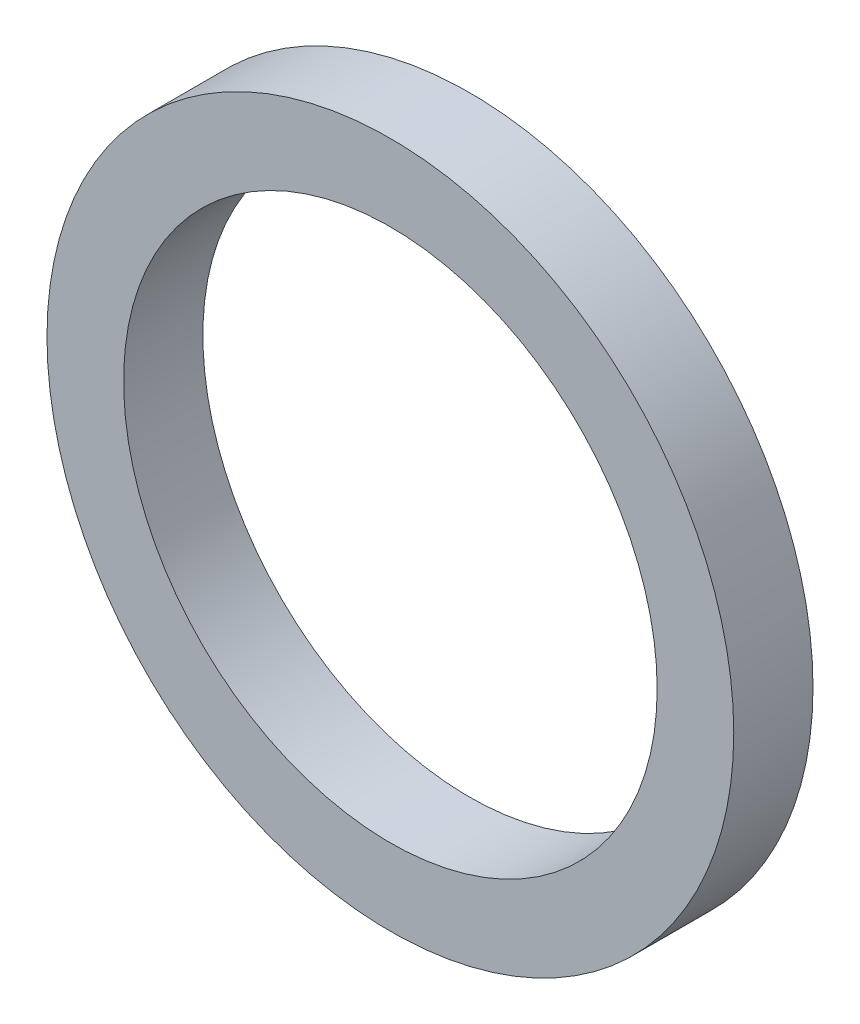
from build123d import *

# Parameters (mm, degrees)
SKETCH_1_R                   = 13
SKETCH_1_R_2                 = 10.1
WRIST_AXIAL_SPACER_3MM_DEPTH = 1.5


with BuildPart() as part:
    # Sketch 1 → Wrist_Axial_Spacer_3mm (new, symmetric)
    with BuildSketch(Plane.XY):
        Circle(SKETCH_1_R)
        Circle(SKETCH_1_R_2, mode=Mode.SUBTRACT)
    extrude(amount=WRIST_AXIAL_SPACER_3MM_DEPTH, both=True)


solid = part.part
